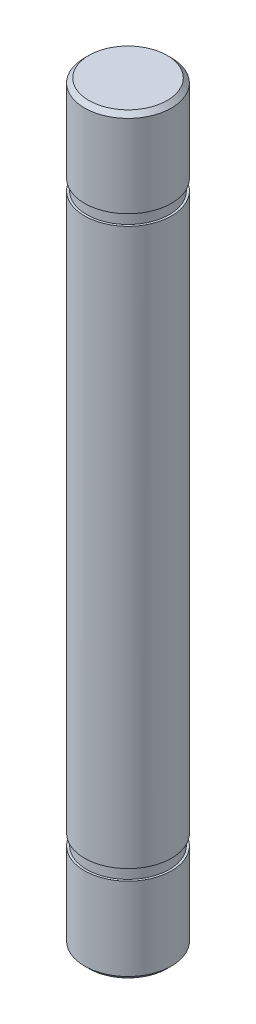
ISO-10303-21;
HEADER;
FILE_DESCRIPTION(('STEP AP214'),'2;1');
FILE_NAME('part.step','',(''),(''),'','','');
FILE_SCHEMA(('AUTOMOTIVE_DESIGN { 1 0 10303 214 1 1 1 1 }'));
ENDSEC;
DATA;
#1=APPLICATION_CONTEXT('core data for automotive mechanical design processes');
#2=APPLICATION_PROTOCOL_DEFINITION('international standard','automotive_design',2000,#1);
#3=PRODUCT_CONTEXT('',#1,'mechanical');
#4=PRODUCT('Part','Part','',(#3));
#5=PRODUCT_RELATED_PRODUCT_CATEGORY('part','',(#4));
#6=PRODUCT_DEFINITION_FORMATION('','',#4);
#7=PRODUCT_DEFINITION_CONTEXT('part definition',#1,'design');
#8=PRODUCT_DEFINITION('design','',#6,#7);
#9=PRODUCT_DEFINITION_SHAPE('','',#8);
#10=(LENGTH_UNIT() NAMED_UNIT(*) SI_UNIT(.MILLI.,.METRE.));
#11=(NAMED_UNIT(*) PLANE_ANGLE_UNIT() SI_UNIT($,.RADIAN.));
#12=(NAMED_UNIT(*) SI_UNIT($,.STERADIAN.) SOLID_ANGLE_UNIT());
#13=UNCERTAINTY_MEASURE_WITH_UNIT(LENGTH_MEASURE(1.E-05),#10,'distance_accuracy_value','');
#14=(GEOMETRIC_REPRESENTATION_CONTEXT(3) GLOBAL_UNCERTAINTY_ASSIGNED_CONTEXT((#13)) GLOBAL_UNIT_ASSIGNED_CONTEXT((#10,
#11,#12)) REPRESENTATION_CONTEXT('',''));
#15=CARTESIAN_POINT('',(0.,0.,0.));
#16=DIRECTION('',(0.,0.,1.));
#17=DIRECTION('',(1.,0.,0.));
#18=AXIS2_PLACEMENT_3D('',#15,#16,#17);
#19=CARTESIAN_POINT('',(0.,0.,0.));
#20=DIRECTION('',(0.,-1.,0.));
#21=DIRECTION('',(0.,0.,-1.));
#22=AXIS2_PLACEMENT_3D('',#19,#20,#21);
#23=CYLINDRICAL_SURFACE('',#22,2.);
#24=CARTESIAN_POINT('',(0.,4.5,0.));
#25=DIRECTION('',(0.,-1.,0.));
#26=DIRECTION('',(0.,0.,-1.));
#27=AXIS2_PLACEMENT_3D('',#24,#25,#26);
#28=CIRCLE('',#27,2.);
#29=CARTESIAN_POINT('',(0.,4.5,-2.));
#30=VERTEX_POINT('',#29);
#31=EDGE_CURVE('E59',#30,#30,#28,.T.);
#32=ORIENTED_EDGE('',*,*,#31,.F.);
#33=EDGE_LOOP('',(#32));
#34=FACE_BOUND('',#33,.T.);
#35=CARTESIAN_POINT('',(0.,30.1000000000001,0.));
#36=DIRECTION('',(0.,1.,0.));
#37=DIRECTION('',(0.,0.,1.));
#38=AXIS2_PLACEMENT_3D('',#35,#36,#37);
#39=CIRCLE('',#38,2.);
#40=CARTESIAN_POINT('',(0.,30.1000000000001,2.));
#41=VERTEX_POINT('',#40);
#42=EDGE_CURVE('E62',#41,#41,#39,.T.);
#43=ORIENTED_EDGE('',*,*,#42,.F.);
#44=EDGE_LOOP('',(#43));
#45=FACE_BOUND('',#44,.T.);
#46=ADVANCED_FACE('F30',(#34,#45),#23,.T.);
#47=CARTESIAN_POINT('',(0.,4.,0.));
#48=DIRECTION('',(0.,-1.,0.));
#49=DIRECTION('',(0.,0.,-1.));
#50=AXIS2_PLACEMENT_3D('',#47,#48,#49);
#51=CIRCLE('',#50,2.);
#52=CARTESIAN_POINT('',(0.,4.,-2.));
#53=VERTEX_POINT('',#52);
#54=EDGE_CURVE('E50',#53,#53,#51,.T.);
#55=ORIENTED_EDGE('',*,*,#54,.T.);
#56=EDGE_LOOP('',(#55));
#57=FACE_BOUND('',#56,.T.);
#58=CARTESIAN_POINT('',(0.,0.200000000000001,0.));
#59=DIRECTION('',(0.,-1.,0.));
#60=DIRECTION('',(0.,0.,-1.));
#61=AXIS2_PLACEMENT_3D('',#58,#59,#60);
#62=CIRCLE('',#61,2.);
#63=CARTESIAN_POINT('',(0.,0.200000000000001,-2.));
#64=VERTEX_POINT('',#63);
#65=EDGE_CURVE('E37',#64,#64,#62,.F.);
#66=ORIENTED_EDGE('',*,*,#65,.T.);
#67=EDGE_LOOP('',(#66));
#68=FACE_BOUND('',#67,.T.);
#69=ADVANCED_FACE('F91',(#57,#68),#23,.T.);
#70=CARTESIAN_POINT('',(0.,0.,0.));
#71=DIRECTION('',(0.,-1.,0.));
#72=DIRECTION('',(0.,0.,-1.));
#73=AXIS2_PLACEMENT_3D('',#70,#71,#72);
#74=PLANE('',#73);
#75=CARTESIAN_POINT('',(0.,0.,0.));
#76=DIRECTION('',(0.,-1.,0.));
#77=DIRECTION('',(0.,0.,-1.));
#78=AXIS2_PLACEMENT_3D('',#75,#76,#77);
#79=CIRCLE('',#78,1.8);
#80=CARTESIAN_POINT('',(0.,0.,-1.8));
#81=VERTEX_POINT('',#80);
#82=EDGE_CURVE('E45',#81,#81,#79,.T.);
#83=ORIENTED_EDGE('',*,*,#82,.T.);
#84=EDGE_LOOP('',(#83));
#85=FACE_BOUND('',#84,.T.);
#86=ADVANCED_FACE('F96',(#85),#74,.T.);
#87=CARTESIAN_POINT('',(0.,0.,0.));
#88=DIRECTION('',(0.,1.,0.));
#89=DIRECTION('',(0.,0.,1.));
#90=AXIS2_PLACEMENT_3D('',#87,#88,#89);
#91=CONICAL_SURFACE('',#90,1.8,0.785398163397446);
#92=ORIENTED_EDGE('',*,*,#65,.F.);
#93=EDGE_LOOP('',(#92));
#94=FACE_BOUND('',#93,.T.);
#95=ORIENTED_EDGE('',*,*,#82,.F.);
#96=EDGE_LOOP('',(#95));
#97=FACE_BOUND('',#96,.T.);
#98=ADVANCED_FACE('F116',(#94,#97),#91,.T.);
#99=CARTESIAN_POINT('',(2.,4.,0.));
#100=DIRECTION('',(0.,-1.,0.));
#101=DIRECTION('',(0.,0.,-1.));
#102=AXIS2_PLACEMENT_3D('',#99,#100,#101);
#103=PLANE('',#102);
#104=ORIENTED_EDGE('',*,*,#54,.F.);
#105=EDGE_LOOP('',(#104));
#106=FACE_BOUND('',#105,.T.);
#107=CARTESIAN_POINT('',(0.,4.,0.));
#108=DIRECTION('',(0.,-1.,0.));
#109=DIRECTION('',(0.,0.,-1.));
#110=AXIS2_PLACEMENT_3D('',#107,#108,#109);
#111=CIRCLE('',#110,1.9);
#112=CARTESIAN_POINT('',(0.,4.,-1.9));
#113=VERTEX_POINT('',#112);
#114=EDGE_CURVE('E53',#113,#113,#111,.T.);
#115=ORIENTED_EDGE('',*,*,#114,.T.);
#116=EDGE_LOOP('',(#115));
#117=FACE_BOUND('',#116,.T.);
#118=ADVANCED_FACE('F114',(#106,#117),#103,.F.);
#119=CARTESIAN_POINT('',(0.,0.,0.));
#120=DIRECTION('',(0.,-1.,0.));
#121=DIRECTION('',(0.,0.,-1.));
#122=AXIS2_PLACEMENT_3D('',#119,#120,#121);
#123=CYLINDRICAL_SURFACE('',#122,1.9);
#124=ORIENTED_EDGE('',*,*,#114,.F.);
#125=EDGE_LOOP('',(#124));
#126=FACE_BOUND('',#125,.T.);
#127=CARTESIAN_POINT('',(0.,4.5,0.));
#128=DIRECTION('',(0.,-1.,0.));
#129=DIRECTION('',(0.,0.,-1.));
#130=AXIS2_PLACEMENT_3D('',#127,#128,#129);
#131=CIRCLE('',#130,1.9);
#132=CARTESIAN_POINT('',(0.,4.5,-1.9));
#133=VERTEX_POINT('',#132);
#134=EDGE_CURVE('E56',#133,#133,#131,.T.);
#135=ORIENTED_EDGE('',*,*,#134,.T.);
#136=EDGE_LOOP('',(#135));
#137=FACE_BOUND('',#136,.T.);
#138=ADVANCED_FACE('F138',(#126,#137),#123,.T.);
#139=CARTESIAN_POINT('',(2.,4.5,0.));
#140=DIRECTION('',(0.,1.,0.));
#141=DIRECTION('',(0.,0.,1.));
#142=AXIS2_PLACEMENT_3D('',#139,#140,#141);
#143=PLANE('',#142);
#144=ORIENTED_EDGE('',*,*,#134,.F.);
#145=EDGE_LOOP('',(#144));
#146=FACE_BOUND('',#145,.T.);
#147=ORIENTED_EDGE('',*,*,#31,.T.);
#148=EDGE_LOOP('',(#147));
#149=FACE_BOUND('',#148,.T.);
#150=ADVANCED_FACE('F145',(#146,#149),#143,.F.);
#151=CARTESIAN_POINT('',(2.,30.1000000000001,0.));
#152=DIRECTION('',(0.,1.,0.));
#153=DIRECTION('',(0.,0.,1.));
#154=AXIS2_PLACEMENT_3D('',#151,#152,#153);
#155=PLANE('',#154);
#156=ORIENTED_EDGE('',*,*,#42,.T.);
#157=EDGE_LOOP('',(#156));
#158=FACE_BOUND('',#157,.T.);
#159=CARTESIAN_POINT('',(0.,30.1000000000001,0.));
#160=DIRECTION('',(0.,1.,0.));
#161=DIRECTION('',(0.,0.,1.));
#162=AXIS2_PLACEMENT_3D('',#159,#160,#161);
#163=CIRCLE('',#162,1.9);
#164=CARTESIAN_POINT('',(0.,30.1000000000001,1.9));
#165=VERTEX_POINT('',#164);
#166=EDGE_CURVE('E65',#165,#165,#163,.T.);
#167=ORIENTED_EDGE('',*,*,#166,.F.);
#168=EDGE_LOOP('',(#167));
#169=FACE_BOUND('',#168,.T.);
#170=ADVANCED_FACE('F87',(#158,#169),#155,.T.);
#171=CARTESIAN_POINT('',(0.,43.6541363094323,0.));
#172=DIRECTION('',(0.,1.,0.));
#173=DIRECTION('',(0.,0.,1.));
#174=AXIS2_PLACEMENT_3D('',#171,#172,#173);
#175=CYLINDRICAL_SURFACE('',#174,1.9);
#176=ORIENTED_EDGE('',*,*,#166,.T.);
#177=EDGE_LOOP('',(#176));
#178=FACE_BOUND('',#177,.T.);
#179=CARTESIAN_POINT('',(0.,30.6000000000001,0.));
#180=DIRECTION('',(0.,1.,0.));
#181=DIRECTION('',(0.,0.,1.));
#182=AXIS2_PLACEMENT_3D('',#179,#180,#181);
#183=CIRCLE('',#182,1.9);
#184=CARTESIAN_POINT('',(0.,30.6000000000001,1.9));
#185=VERTEX_POINT('',#184);
#186=EDGE_CURVE('E68',#185,#185,#183,.T.);
#187=ORIENTED_EDGE('',*,*,#186,.F.);
#188=EDGE_LOOP('',(#187));
#189=FACE_BOUND('',#188,.T.);
#190=ADVANCED_FACE('F79',(#178,#189),#175,.T.);
#191=CARTESIAN_POINT('',(2.,30.6000000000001,0.));
#192=DIRECTION('',(0.,-1.,0.));
#193=DIRECTION('',(0.,0.,-1.));
#194=AXIS2_PLACEMENT_3D('',#191,#192,#193);
#195=PLANE('',#194);
#196=ORIENTED_EDGE('',*,*,#186,.T.);
#197=EDGE_LOOP('',(#196));
#198=FACE_BOUND('',#197,.T.);
#199=CARTESIAN_POINT('',(0.,30.6000000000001,0.));
#200=DIRECTION('',(0.,1.,0.));
#201=DIRECTION('',(0.,0.,1.));
#202=AXIS2_PLACEMENT_3D('',#199,#200,#201);
#203=CIRCLE('',#202,2.);
#204=CARTESIAN_POINT('',(0.,30.6000000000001,2.));
#205=VERTEX_POINT('',#204);
#206=EDGE_CURVE('E71',#205,#205,#203,.T.);
#207=ORIENTED_EDGE('',*,*,#206,.F.);
#208=EDGE_LOOP('',(#207));
#209=FACE_BOUND('',#208,.T.);
#210=ADVANCED_FACE('F77',(#198,#209),#195,.T.);
#211=CARTESIAN_POINT('',(0.,34.6,0.));
#212=DIRECTION('',(0.,1.,0.));
#213=DIRECTION('',(0.,0.,1.));
#214=AXIS2_PLACEMENT_3D('',#211,#212,#213);
#215=PLANE('',#214);
#216=CARTESIAN_POINT('',(0.,34.6,0.));
#217=DIRECTION('',(0.,1.,0.));
#218=DIRECTION('',(0.,0.,1.));
#219=AXIS2_PLACEMENT_3D('',#216,#217,#218);
#220=CIRCLE('',#219,1.8);
#221=CARTESIAN_POINT('',(0.,34.6,1.8));
#222=VERTEX_POINT('',#221);
#223=EDGE_CURVE('E10',#222,#222,#220,.T.);
#224=ORIENTED_EDGE('',*,*,#223,.T.);
#225=EDGE_LOOP('',(#224));
#226=FACE_BOUND('',#225,.T.);
#227=ADVANCED_FACE('F32',(#226),#215,.T.);
#228=CARTESIAN_POINT('',(0.,34.4,0.));
#229=DIRECTION('',(0.,-1.,0.));
#230=DIRECTION('',(0.,0.,-1.));
#231=AXIS2_PLACEMENT_3D('',#228,#229,#230);
#232=CONICAL_SURFACE('',#231,2.,0.785398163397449);
#233=ORIENTED_EDGE('',*,*,#223,.F.);
#234=EDGE_LOOP('',(#233));
#235=FACE_BOUND('',#234,.T.);
#236=CARTESIAN_POINT('',(0.,34.4,0.));
#237=DIRECTION('',(0.,1.,0.));
#238=DIRECTION('',(0.,0.,1.));
#239=AXIS2_PLACEMENT_3D('',#236,#237,#238);
#240=CIRCLE('',#239,2.);
#241=CARTESIAN_POINT('',(0.,34.4,2.));
#242=VERTEX_POINT('',#241);
#243=EDGE_CURVE('E41',#242,#242,#240,.F.);
#244=ORIENTED_EDGE('',*,*,#243,.F.);
#245=EDGE_LOOP('',(#244));
#246=FACE_BOUND('',#245,.T.);
#247=ADVANCED_FACE('F86',(#235,#246),#232,.T.);
#248=ORIENTED_EDGE('',*,*,#243,.T.);
#249=EDGE_LOOP('',(#248));
#250=FACE_BOUND('',#249,.T.);
#251=ORIENTED_EDGE('',*,*,#206,.T.);
#252=EDGE_LOOP('',(#251));
#253=FACE_BOUND('',#252,.T.);
#254=ADVANCED_FACE('F75',(#250,#253),#23,.T.);
#255=CLOSED_SHELL('',(#46,#69,#86,#98,#118,#138,#150,#170,#190,#210,#227,#247,#254));
#256=MANIFOLD_SOLID_BREP('B2',#255);
#257=ADVANCED_BREP_SHAPE_REPRESENTATION('',(#18,#256),#14);
#258=SHAPE_DEFINITION_REPRESENTATION(#9,#257);
ENDSEC;
END-ISO-10303-21;
